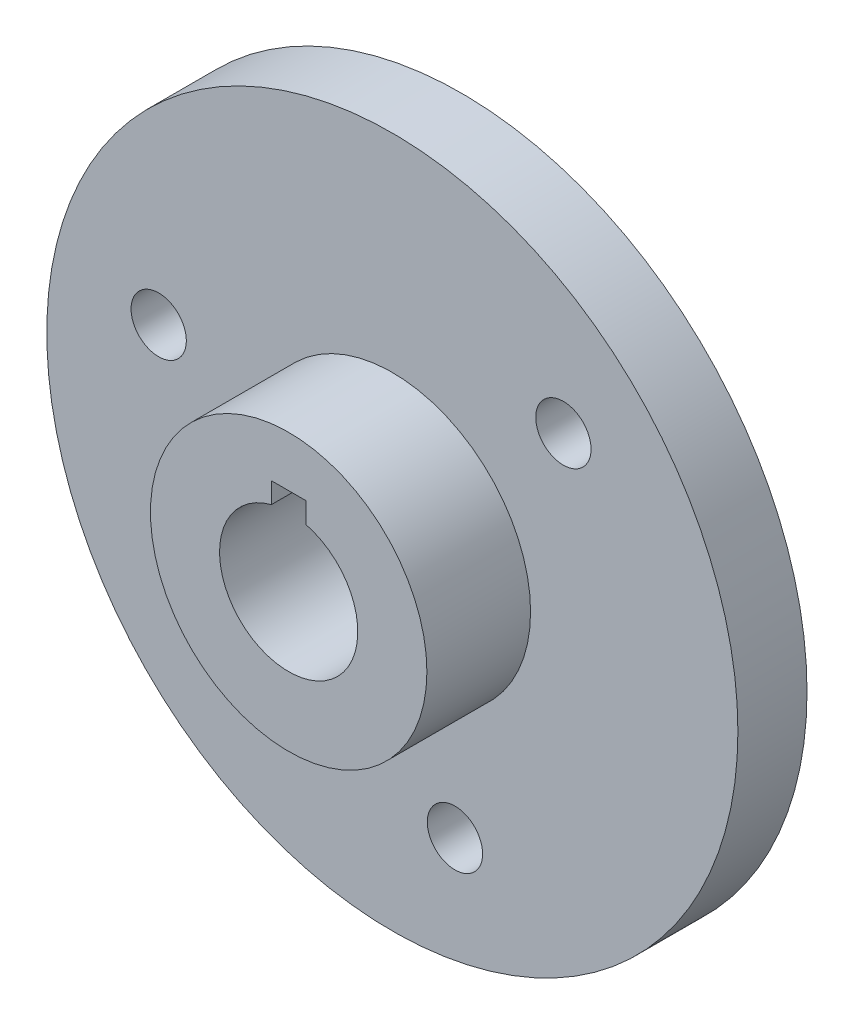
from build123d import *

# Parameters (mm, degrees)
SKETCH2_R          = 10
CUT_EXTRUDE1_DEPTH = 76
SKETCH3_R          = 4
CUT_EXTRUDE2_DEPTH = 73.284161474
CIRPATTERN1_COUNT  = 3
CUT_EXTRUDE3_DEPTH = 76


with BuildPart() as part:
    # Sketch1 → Revolve1 (revolve)
    with BuildSketch(Plane(origin=(0, 0, 0), x_dir=(0, 0, -1), z_dir=(1, 0, 0)), mode=Mode.PRIVATE) as revolve1_sk:
        Polygon((0, 0), (0, 20), (15, 20), (15, 50), (25, 50), (25, 0), align=None)
    revolve(revolve1_sk.sketch.rotate(Axis((0, 0, 0), (0, 0, -1)), 90), axis=Axis((0, 0, 0), (0, 0, -1)))

    # Sketch2 → Cut-Extrude1 (cut, through all)
    with BuildSketch(Plane.XY):
        Circle(SKETCH2_R)
    extrude(amount=-CUT_EXTRUDE1_DEPTH, mode=Mode.SUBTRACT)

    # Sketch3 → Cut-Extrude2 (cut, through all)
    with BuildSketch(Plane.XY.offset(-15)):
        with Locations((24.748737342, 24.748737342)):
            Circle(SKETCH3_R)
    cut_extrude2 = extrude(amount=-CUT_EXTRUDE2_DEPTH, mode=Mode.SUBTRACT)

    # CirPattern1: Cut-Extrude2 ×3 about axis
    cirpattern1_axis = Axis((0, 0, 0), (0, 0, 1))
    for i in range(1, CIRPATTERN1_COUNT):
        add(cut_extrude2.rotate(cirpattern1_axis, i * 360 / CIRPATTERN1_COUNT), mode=Mode.SUBTRACT)

    # Sketch4 → Cut-Extrude3 (cut, through all)
    with BuildSketch(Plane.XY):
        with BuildLine():
            Line((2.5, 9.682458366), (2.5, 12.682458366))
            Line((2.5, 12.682458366), (-2.5, 12.682458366))
            Line((-2.5, 12.682458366), (-2.5, 9.682458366))
            ThreePointArc((-2.5, 9.682458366), (0, 10), (2.5, 9.682458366))
        make_face()
    extrude(amount=-CUT_EXTRUDE3_DEPTH, mode=Mode.SUBTRACT)


solid = part.part
